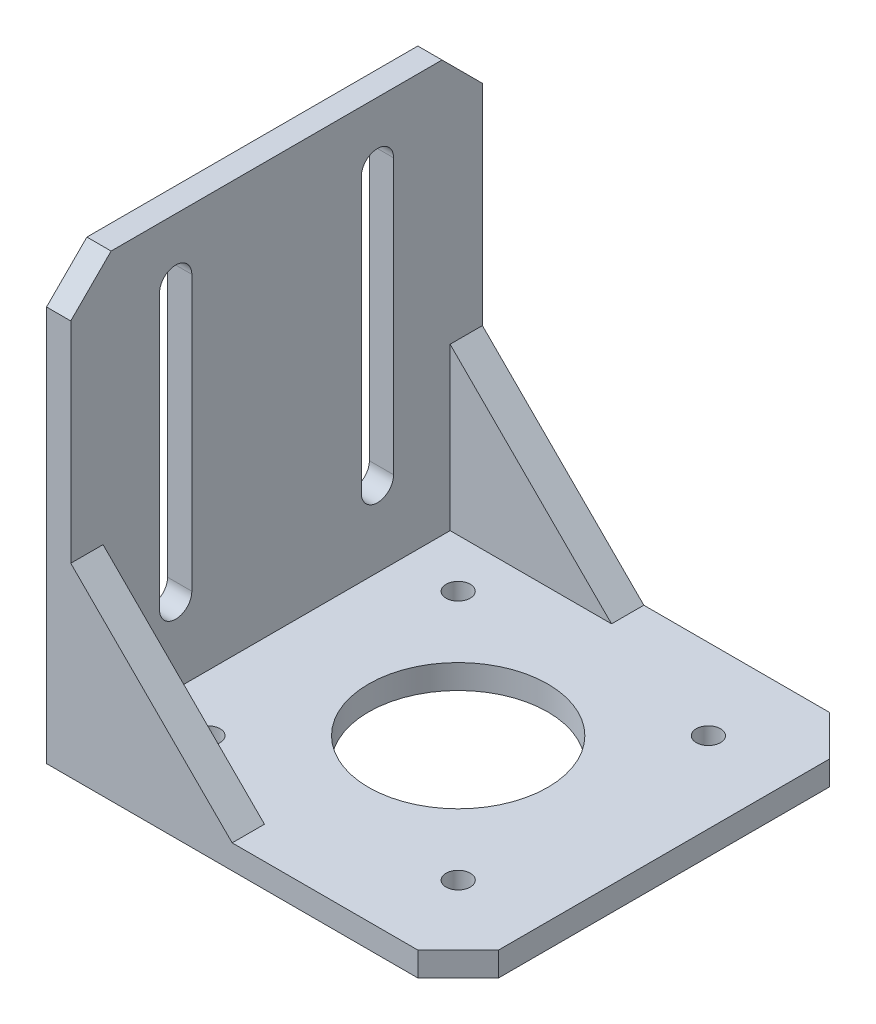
from build123d import *

# Parameters (mm, degrees)
SKETCH1_R           = 11.1
SKETCH1_R_2         = 1.5
BOSS_EXTRUDE1_DEPTH = 3
BOSS_EXTRUDE2_DEPTH = 3
RIB2_REACH          = 80.532
SKETCH5_WALL_W      = 187.3479526
SKETCH5_WALL_H      = 4


with BuildPart() as part:
    # Sketch1 → Boss-Extrude1 (new body)
    with BuildSketch(Plane(origin=(0, 0, 0), x_dir=(1, 0, 0), z_dir=(0, 1, 0))):
        Polygon((-25.5, -25.5), (20.5, -25.5), (25.5, -20.5), (25.5, 20.5), (20.5, 25.5), (-25.5, 25.5), align=None)
        with Locations(Location((0, 0, 0), (0, 0, 270))):
            Circle(SKETCH1_R, mode=Mode.SUBTRACT)
        with Locations(Location((15.5, 15.5, 0), (0, 0, 270))):
            Circle(SKETCH1_R_2, mode=Mode.SUBTRACT)
        with Locations(Location((-15.5, 15.5, 0), (0, 0, 270))):
            Circle(SKETCH1_R_2, mode=Mode.SUBTRACT)
        with Locations(Location((-15.5, -15.5, 0), (0, 0, 270))):
            Circle(SKETCH1_R_2, mode=Mode.SUBTRACT)
        with Locations(Location((15.5, -15.5, 0), (0, 0, 270))):
            Circle(SKETCH1_R_2, mode=Mode.SUBTRACT)
    extrude(amount=BOSS_EXTRUDE1_DEPTH)

    # Sketch2 → Boss-Extrude2 (add)
    with BuildSketch(Plane.ZY.offset(25.5)):
        Polygon((-25.5, 3), (25.5, 3), (25.5, 49), (20.5, 54), (-20.5, 54), (-25.5, 49), align=None)
        with BuildLine():
            Line((-10.5, 46.5), (-10.5, 12.5))
            ThreePointArc((-10.5, 12.5), (-12.5, 10.5), (-14.5, 12.5))
            Line((-14.5, 12.5), (-14.5, 46.5))
            ThreePointArc((-14.5, 46.5), (-12.5, 48.5), (-10.5, 46.5))
        make_face(mode=Mode.SUBTRACT)
        with BuildLine():
            Line((14.5, 46.5), (14.5, 12.5))
            ThreePointArc((14.5, 12.5), (12.5, 10.5), (10.5, 12.5))
            Line((10.5, 12.5), (10.5, 46.5))
            ThreePointArc((10.5, 46.5), (12.5, 48.5), (14.5, 46.5))
        make_face(mode=Mode.SUBTRACT)
    extrude(amount=-BOSS_EXTRUDE2_DEPTH)

    # Sketch5 wall → Rib2 (add, up to next)
    with BuildSketch(Plane(origin=(-12.5, 13, 25.5), x_dir=(0.707106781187, -0.707106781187, 0), z_dir=(0.707106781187, 0.707106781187, 0)), mode=Mode.PRIVATE) as rib2_sk1:
        with Locations((0, 2)):
            Rectangle(SKETCH5_WALL_W, SKETCH5_WALL_H)
    rib2_tool1 = extrude(rib2_sk1.sketch, amount=-RIB2_REACH, mode=Mode.PRIVATE) - part.part
    rib2 = rib2_tool1.solids().sort_by_distance((-12.5, 13, 25.5))[0]
    add(rib2)

    # Mirror1: Rib2 across plane
    add(rib2.mirror(Plane.XY))


solid = part.part
